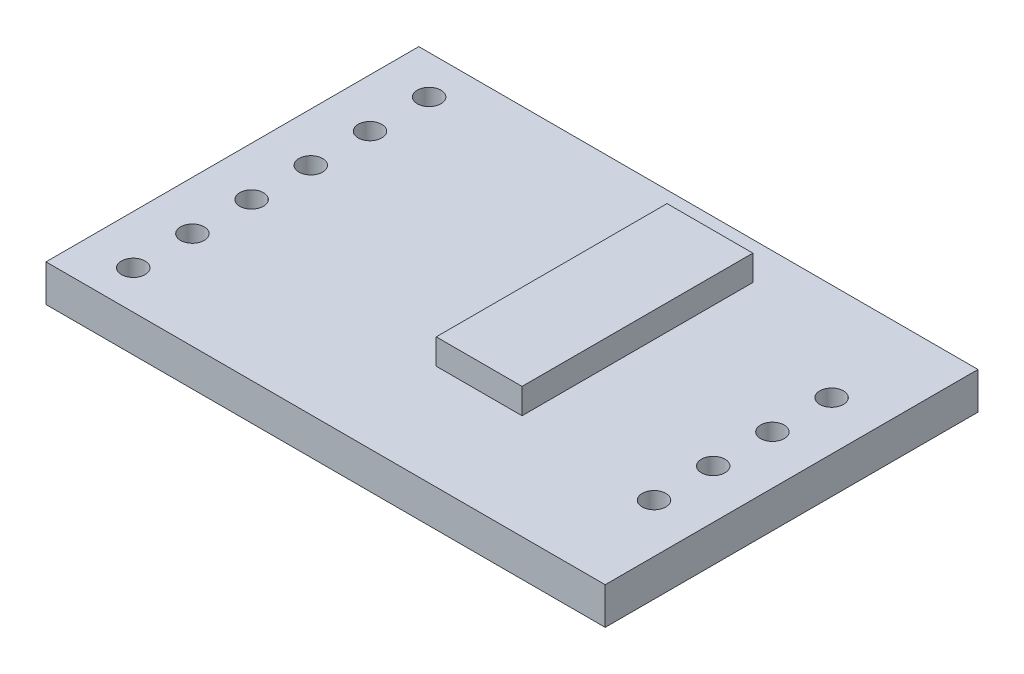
ISO-10303-21;
HEADER;
FILE_DESCRIPTION(('STEP AP214'),'2;1');
FILE_NAME('part.step','',(''),(''),'','','');
FILE_SCHEMA(('AUTOMOTIVE_DESIGN { 1 0 10303 214 1 1 1 1 }'));
ENDSEC;
DATA;
#1=APPLICATION_CONTEXT('core data for automotive mechanical design processes');
#2=APPLICATION_PROTOCOL_DEFINITION('international standard','automotive_design',2000,#1);
#3=PRODUCT_CONTEXT('',#1,'mechanical');
#4=PRODUCT('Part','Part','',(#3));
#5=PRODUCT_RELATED_PRODUCT_CATEGORY('part','',(#4));
#6=PRODUCT_DEFINITION_FORMATION('','',#4);
#7=PRODUCT_DEFINITION_CONTEXT('part definition',#1,'design');
#8=PRODUCT_DEFINITION('design','',#6,#7);
#9=PRODUCT_DEFINITION_SHAPE('','',#8);
#10=(LENGTH_UNIT() NAMED_UNIT(*) SI_UNIT(.MILLI.,.METRE.));
#11=(NAMED_UNIT(*) PLANE_ANGLE_UNIT() SI_UNIT($,.RADIAN.));
#12=(NAMED_UNIT(*) SI_UNIT($,.STERADIAN.) SOLID_ANGLE_UNIT());
#13=UNCERTAINTY_MEASURE_WITH_UNIT(LENGTH_MEASURE(1.E-05),#10,'distance_accuracy_value','');
#14=(GEOMETRIC_REPRESENTATION_CONTEXT(3) GLOBAL_UNCERTAINTY_ASSIGNED_CONTEXT((#13)) GLOBAL_UNIT_ASSIGNED_CONTEXT((#10,
#11,#12)) REPRESENTATION_CONTEXT('',''));
#15=CARTESIAN_POINT('',(0.,0.,0.));
#16=DIRECTION('',(0.,0.,1.));
#17=DIRECTION('',(1.,0.,0.));
#18=AXIS2_PLACEMENT_3D('',#15,#16,#17);
#19=CARTESIAN_POINT('',(3.93699999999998,2.6797,3.5062));
#20=DIRECTION('',(-1.,0.,0.));
#21=DIRECTION('',(0.,0.,1.));
#22=AXIS2_PLACEMENT_3D('',#19,#20,#21);
#23=PLANE('',#22);
#24=DIRECTION('',(0.,0.,-1.));
#25=VECTOR('',#24,1.);
#26=CARTESIAN_POINT('',(3.93699999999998,1.5875,3.5062));
#27=LINE('',#26,#25);
#28=CARTESIAN_POINT('',(3.93699999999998,1.5875,3.5062));
#29=VERTEX_POINT('',#28);
#30=CARTESIAN_POINT('',(3.93699999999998,1.5875,-6.3998));
#31=VERTEX_POINT('',#30);
#32=EDGE_CURVE('E107',#29,#31,#27,.T.);
#33=ORIENTED_EDGE('',*,*,#32,.T.);
#34=DIRECTION('',(0.,-1.,0.));
#35=VECTOR('',#34,1.);
#36=CARTESIAN_POINT('',(3.93699999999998,2.6797,-6.3998));
#37=LINE('',#36,#35);
#38=CARTESIAN_POINT('',(3.93699999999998,2.6797,-6.3998));
#39=VERTEX_POINT('',#38);
#40=EDGE_CURVE('E12',#39,#31,#37,.T.);
#41=ORIENTED_EDGE('',*,*,#40,.F.);
#42=DIRECTION('',(0.,0.,-1.));
#43=VECTOR('',#42,1.);
#44=CARTESIAN_POINT('',(3.93699999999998,2.6797,3.5062));
#45=LINE('',#44,#43);
#46=CARTESIAN_POINT('',(3.93699999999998,2.6797,3.5062));
#47=VERTEX_POINT('',#46);
#48=EDGE_CURVE('E95',#47,#39,#45,.T.);
#49=ORIENTED_EDGE('',*,*,#48,.F.);
#50=DIRECTION('',(0.,-1.,0.));
#51=VECTOR('',#50,1.);
#52=CARTESIAN_POINT('',(3.93699999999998,2.6797,3.5062));
#53=LINE('',#52,#51);
#54=EDGE_CURVE('E103',#47,#29,#53,.T.);
#55=ORIENTED_EDGE('',*,*,#54,.T.);
#56=EDGE_LOOP('',(#33,#41,#49,#55));
#57=FACE_BOUND('',#56,.T.);
#58=ADVANCED_FACE('F44',(#57),#23,.F.);
#59=CARTESIAN_POINT('',(0.25399999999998,2.6797,-6.3998));
#60=DIRECTION('',(0.,0.,1.));
#61=DIRECTION('',(1.,0.,0.));
#62=AXIS2_PLACEMENT_3D('',#59,#60,#61);
#63=PLANE('',#62);
#64=DIRECTION('',(-1.,0.,0.));
#65=VECTOR('',#64,1.);
#66=CARTESIAN_POINT('',(0.25399999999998,1.5875,-6.3998));
#67=LINE('',#66,#65);
#68=CARTESIAN_POINT('',(0.25399999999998,1.5875,-6.3998));
#69=VERTEX_POINT('',#68);
#70=EDGE_CURVE('E99',#31,#69,#67,.T.);
#71=ORIENTED_EDGE('',*,*,#70,.T.);
#72=DIRECTION('',(0.,-1.,0.));
#73=VECTOR('',#72,1.);
#74=CARTESIAN_POINT('',(0.25399999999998,2.6797,-6.3998));
#75=LINE('',#74,#73);
#76=CARTESIAN_POINT('',(0.25399999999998,2.6797,-6.3998));
#77=VERTEX_POINT('',#76);
#78=EDGE_CURVE('E52',#77,#69,#75,.T.);
#79=ORIENTED_EDGE('',*,*,#78,.F.);
#80=DIRECTION('',(-1.,0.,0.));
#81=VECTOR('',#80,1.);
#82=CARTESIAN_POINT('',(0.25399999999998,2.6797,-6.3998));
#83=LINE('',#82,#81);
#84=EDGE_CURVE('E90',#39,#77,#83,.T.);
#85=ORIENTED_EDGE('',*,*,#84,.F.);
#86=ORIENTED_EDGE('',*,*,#40,.T.);
#87=EDGE_LOOP('',(#71,#79,#85,#86));
#88=FACE_BOUND('',#87,.T.);
#89=ADVANCED_FACE('F98',(#88),#63,.F.);
#90=CARTESIAN_POINT('',(0.25399999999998,2.6797,3.5062));
#91=DIRECTION('',(1.,0.,0.));
#92=DIRECTION('',(0.,0.,-1.));
#93=AXIS2_PLACEMENT_3D('',#90,#91,#92);
#94=PLANE('',#93);
#95=DIRECTION('',(0.,0.,1.));
#96=VECTOR('',#95,1.);
#97=CARTESIAN_POINT('',(0.25399999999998,1.5875,3.5062));
#98=LINE('',#97,#96);
#99=CARTESIAN_POINT('',(0.25399999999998,1.5875,3.5062));
#100=VERTEX_POINT('',#99);
#101=EDGE_CURVE('E77',#69,#100,#98,.T.);
#102=ORIENTED_EDGE('',*,*,#101,.T.);
#103=DIRECTION('',(0.,-1.,0.));
#104=VECTOR('',#103,1.);
#105=CARTESIAN_POINT('',(0.25399999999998,2.6797,3.5062));
#106=LINE('',#105,#104);
#107=CARTESIAN_POINT('',(0.25399999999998,2.6797,3.5062));
#108=VERTEX_POINT('',#107);
#109=EDGE_CURVE('E100',#108,#100,#106,.T.);
#110=ORIENTED_EDGE('',*,*,#109,.F.);
#111=DIRECTION('',(0.,0.,1.));
#112=VECTOR('',#111,1.);
#113=CARTESIAN_POINT('',(0.25399999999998,2.6797,3.5062));
#114=LINE('',#113,#112);
#115=EDGE_CURVE('E93',#77,#108,#114,.T.);
#116=ORIENTED_EDGE('',*,*,#115,.F.);
#117=ORIENTED_EDGE('',*,*,#78,.T.);
#118=EDGE_LOOP('',(#102,#110,#116,#117));
#119=FACE_BOUND('',#118,.T.);
#120=ADVANCED_FACE('F101',(#119),#94,.F.);
#121=CARTESIAN_POINT('',(0.25399999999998,2.6797,3.5062));
#122=DIRECTION('',(0.,0.,-1.));
#123=DIRECTION('',(-1.,0.,0.));
#124=AXIS2_PLACEMENT_3D('',#121,#122,#123);
#125=PLANE('',#124);
#126=DIRECTION('',(1.,0.,0.));
#127=VECTOR('',#126,1.);
#128=CARTESIAN_POINT('',(0.25399999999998,1.5875,3.5062));
#129=LINE('',#128,#127);
#130=EDGE_CURVE('E83',#100,#29,#129,.T.);
#131=ORIENTED_EDGE('',*,*,#130,.T.);
#132=ORIENTED_EDGE('',*,*,#54,.F.);
#133=DIRECTION('',(1.,0.,0.));
#134=VECTOR('',#133,1.);
#135=CARTESIAN_POINT('',(0.25399999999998,2.6797,3.5062));
#136=LINE('',#135,#134);
#137=EDGE_CURVE('E60',#108,#47,#136,.T.);
#138=ORIENTED_EDGE('',*,*,#137,.F.);
#139=ORIENTED_EDGE('',*,*,#109,.T.);
#140=EDGE_LOOP('',(#131,#132,#138,#139));
#141=FACE_BOUND('',#140,.T.);
#142=ADVANCED_FACE('F114',(#141),#125,.F.);
#143=CARTESIAN_POINT('',(0.,2.6797,0.));
#144=DIRECTION('',(0.,-1.,0.));
#145=DIRECTION('',(0.,0.,-1.));
#146=AXIS2_PLACEMENT_3D('',#143,#144,#145);
#147=PLANE('',#146);
#148=ORIENTED_EDGE('',*,*,#48,.T.);
#149=ORIENTED_EDGE('',*,*,#84,.T.);
#150=ORIENTED_EDGE('',*,*,#115,.T.);
#151=ORIENTED_EDGE('',*,*,#137,.T.);
#152=EDGE_LOOP('',(#148,#149,#150,#151));
#153=FACE_BOUND('',#152,.T.);
#154=ADVANCED_FACE('F91',(#153),#147,.F.);
#155=CARTESIAN_POINT('',(0.,1.5875,0.));
#156=DIRECTION('',(0.,-1.,0.));
#157=DIRECTION('',(0.,0.,-1.));
#158=AXIS2_PLACEMENT_3D('',#155,#156,#157);
#159=PLANE('',#158);
#160=ORIENTED_EDGE('',*,*,#32,.F.);
#161=ORIENTED_EDGE('',*,*,#130,.F.);
#162=ORIENTED_EDGE('',*,*,#101,.F.);
#163=ORIENTED_EDGE('',*,*,#70,.F.);
#164=EDGE_LOOP('',(#160,#161,#162,#163));
#165=FACE_BOUND('',#164,.T.);
#166=ADVANCED_FACE('F117',(#165),#159,.T.);
#167=CLOSED_SHELL('',(#58,#89,#120,#142,#154,#166));
#168=MANIFOLD_SOLID_BREP('B2',#167);
#169=CARTESIAN_POINT('',(0.,1.5875,0.));
#170=DIRECTION('',(0.,-1.,0.));
#171=DIRECTION('',(0.,0.,-1.));
#172=AXIS2_PLACEMENT_3D('',#169,#170,#171);
#173=PLANE('',#172);
#174=CARTESIAN_POINT('',(-9.90600000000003,1.5875,-3.81));
#175=DIRECTION('',(0.,1.,0.));
#176=DIRECTION('',(0.,0.,1.));
#177=AXIS2_PLACEMENT_3D('',#174,#175,#176);
#178=CIRCLE('',#177,0.508);
#179=CARTESIAN_POINT('',(-9.90600000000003,1.5875,-3.302));
#180=VERTEX_POINT('',#179);
#181=EDGE_CURVE('E291',#180,#180,#178,.T.);
#182=ORIENTED_EDGE('',*,*,#181,.F.);
#183=EDGE_LOOP('',(#182));
#184=FACE_BOUND('',#183,.T.);
#185=CARTESIAN_POINT('',(-9.90600000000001,1.5875,1.27));
#186=DIRECTION('',(0.,1.,0.));
#187=DIRECTION('',(0.,0.,1.));
#188=AXIS2_PLACEMENT_3D('',#185,#186,#187);
#189=CIRCLE('',#188,0.508);
#190=CARTESIAN_POINT('',(-9.90600000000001,1.5875,1.778));
#191=VERTEX_POINT('',#190);
#192=EDGE_CURVE('E279',#191,#191,#189,.T.);
#193=ORIENTED_EDGE('',*,*,#192,.F.);
#194=EDGE_LOOP('',(#193));
#195=FACE_BOUND('',#194,.T.);
#196=CARTESIAN_POINT('',(9.90599999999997,1.5875,-3.81));
#197=DIRECTION('',(0.,1.,0.));
#198=DIRECTION('',(0.,0.,1.));
#199=AXIS2_PLACEMENT_3D('',#196,#197,#198);
#200=CIRCLE('',#199,0.508);
#201=CARTESIAN_POINT('',(9.90599999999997,1.5875,-3.302));
#202=VERTEX_POINT('',#201);
#203=EDGE_CURVE('E267',#202,#202,#200,.T.);
#204=ORIENTED_EDGE('',*,*,#203,.F.);
#205=EDGE_LOOP('',(#204));
#206=FACE_BOUND('',#205,.T.);
#207=CARTESIAN_POINT('',(9.90599999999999,1.5875,1.27));
#208=DIRECTION('',(0.,1.,0.));
#209=DIRECTION('',(0.,0.,1.));
#210=AXIS2_PLACEMENT_3D('',#207,#208,#209);
#211=CIRCLE('',#210,0.508);
#212=CARTESIAN_POINT('',(9.90599999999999,1.5875,1.778));
#213=VERTEX_POINT('',#212);
#214=EDGE_CURVE('E255',#213,#213,#211,.T.);
#215=ORIENTED_EDGE('',*,*,#214,.F.);
#216=EDGE_LOOP('',(#215));
#217=FACE_BOUND('',#216,.T.);
#218=CARTESIAN_POINT('',(-9.906,1.5875,6.35));
#219=DIRECTION('',(0.,1.,0.));
#220=DIRECTION('',(0.,0.,1.));
#221=AXIS2_PLACEMENT_3D('',#218,#219,#220);
#222=CIRCLE('',#221,0.508);
#223=CARTESIAN_POINT('',(-9.906,1.5875,6.858));
#224=VERTEX_POINT('',#223);
#225=EDGE_CURVE('E234',#224,#224,#222,.T.);
#226=ORIENTED_EDGE('',*,*,#225,.F.);
#227=EDGE_LOOP('',(#226));
#228=FACE_BOUND('',#227,.T.);
#229=DIRECTION('',(0.,0.,-1.));
#230=VECTOR('',#229,1.);
#231=CARTESIAN_POINT('',(12.,1.5875,8.));
#232=LINE('',#231,#230);
#233=CARTESIAN_POINT('',(12.,1.5875,8.));
#234=VERTEX_POINT('',#233);
#235=CARTESIAN_POINT('',(12.,1.5875,-8.));
#236=VERTEX_POINT('',#235);
#237=EDGE_CURVE('E219',#234,#236,#232,.T.);
#238=ORIENTED_EDGE('',*,*,#237,.T.);
#239=DIRECTION('',(-1.,0.,0.));
#240=VECTOR('',#239,1.);
#241=CARTESIAN_POINT('',(-12.,1.5875,-8.));
#242=LINE('',#241,#240);
#243=CARTESIAN_POINT('',(-12.,1.5875,-8.));
#244=VERTEX_POINT('',#243);
#245=EDGE_CURVE('E214',#236,#244,#242,.T.);
#246=ORIENTED_EDGE('',*,*,#245,.T.);
#247=DIRECTION('',(0.,0.,1.));
#248=VECTOR('',#247,1.);
#249=CARTESIAN_POINT('',(-12.,1.5875,8.));
#250=LINE('',#249,#248);
#251=CARTESIAN_POINT('',(-12.,1.5875,8.));
#252=VERTEX_POINT('',#251);
#253=EDGE_CURVE('E217',#244,#252,#250,.T.);
#254=ORIENTED_EDGE('',*,*,#253,.T.);
#255=DIRECTION('',(1.,0.,0.));
#256=VECTOR('',#255,1.);
#257=CARTESIAN_POINT('',(-12.,1.5875,8.));
#258=LINE('',#257,#256);
#259=EDGE_CURVE('E184',#252,#234,#258,.T.);
#260=ORIENTED_EDGE('',*,*,#259,.T.);
#261=EDGE_LOOP('',(#238,#246,#254,#260));
#262=FACE_BOUND('',#261,.T.);
#263=CARTESIAN_POINT('',(9.906,1.5875,3.81));
#264=DIRECTION('',(0.,1.,0.));
#265=DIRECTION('',(0.,0.,1.));
#266=AXIS2_PLACEMENT_3D('',#263,#264,#265);
#267=CIRCLE('',#266,0.508);
#268=CARTESIAN_POINT('',(9.906,1.5875,4.318));
#269=VERTEX_POINT('',#268);
#270=EDGE_CURVE('E249',#269,#269,#267,.T.);
#271=ORIENTED_EDGE('',*,*,#270,.F.);
#272=EDGE_LOOP('',(#271));
#273=FACE_BOUND('',#272,.T.);
#274=CARTESIAN_POINT('',(9.90599999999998,1.5875,-1.27));
#275=DIRECTION('',(0.,1.,0.));
#276=DIRECTION('',(0.,0.,1.));
#277=AXIS2_PLACEMENT_3D('',#274,#275,#276);
#278=CIRCLE('',#277,0.508);
#279=CARTESIAN_POINT('',(9.90599999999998,1.5875,-0.762));
#280=VERTEX_POINT('',#279);
#281=EDGE_CURVE('E261',#280,#280,#278,.T.);
#282=ORIENTED_EDGE('',*,*,#281,.F.);
#283=EDGE_LOOP('',(#282));
#284=FACE_BOUND('',#283,.T.);
#285=CARTESIAN_POINT('',(-9.906,1.5875,3.81));
#286=DIRECTION('',(0.,1.,0.));
#287=DIRECTION('',(0.,0.,1.));
#288=AXIS2_PLACEMENT_3D('',#285,#286,#287);
#289=CIRCLE('',#288,0.508);
#290=CARTESIAN_POINT('',(-9.906,1.5875,4.318));
#291=VERTEX_POINT('',#290);
#292=EDGE_CURVE('E273',#291,#291,#289,.T.);
#293=ORIENTED_EDGE('',*,*,#292,.F.);
#294=EDGE_LOOP('',(#293));
#295=FACE_BOUND('',#294,.T.);
#296=CARTESIAN_POINT('',(-9.90600000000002,1.5875,-1.27));
#297=DIRECTION('',(0.,1.,0.));
#298=DIRECTION('',(0.,0.,1.));
#299=AXIS2_PLACEMENT_3D('',#296,#297,#298);
#300=CIRCLE('',#299,0.508);
#301=CARTESIAN_POINT('',(-9.90600000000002,1.5875,-0.762));
#302=VERTEX_POINT('',#301);
#303=EDGE_CURVE('E285',#302,#302,#300,.T.);
#304=ORIENTED_EDGE('',*,*,#303,.F.);
#305=EDGE_LOOP('',(#304));
#306=FACE_BOUND('',#305,.T.);
#307=CARTESIAN_POINT('',(-9.90600000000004,1.5875,-6.35));
#308=DIRECTION('',(0.,1.,0.));
#309=DIRECTION('',(0.,0.,1.));
#310=AXIS2_PLACEMENT_3D('',#307,#308,#309);
#311=CIRCLE('',#310,0.508);
#312=CARTESIAN_POINT('',(-9.90600000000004,1.5875,-5.842));
#313=VERTEX_POINT('',#312);
#314=EDGE_CURVE('E297',#313,#313,#311,.T.);
#315=ORIENTED_EDGE('',*,*,#314,.F.);
#316=EDGE_LOOP('',(#315));
#317=FACE_BOUND('',#316,.T.);
#318=ADVANCED_FACE('F167',(#184,#195,#206,#217,#228,#262,#273,#284,#295,#306,#317),#173,.F.);
#319=CARTESIAN_POINT('',(0.,0.,0.));
#320=DIRECTION('',(0.,-1.,0.));
#321=DIRECTION('',(0.,0.,-1.));
#322=AXIS2_PLACEMENT_3D('',#319,#320,#321);
#323=PLANE('',#322);
#324=CARTESIAN_POINT('',(-9.90600000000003,0.,-3.81));
#325=DIRECTION('',(0.,1.,0.));
#326=DIRECTION('',(0.,0.,1.));
#327=AXIS2_PLACEMENT_3D('',#324,#325,#326);
#328=CIRCLE('',#327,0.508);
#329=CARTESIAN_POINT('',(-9.90600000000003,0.,-3.302));
#330=VERTEX_POINT('',#329);
#331=EDGE_CURVE('E294',#330,#330,#328,.T.);
#332=ORIENTED_EDGE('',*,*,#331,.T.);
#333=EDGE_LOOP('',(#332));
#334=FACE_BOUND('',#333,.T.);
#335=CARTESIAN_POINT('',(-9.90600000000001,0.,1.27));
#336=DIRECTION('',(0.,1.,0.));
#337=DIRECTION('',(0.,0.,1.));
#338=AXIS2_PLACEMENT_3D('',#335,#336,#337);
#339=CIRCLE('',#338,0.508);
#340=CARTESIAN_POINT('',(-9.90600000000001,0.,1.778));
#341=VERTEX_POINT('',#340);
#342=EDGE_CURVE('E282',#341,#341,#339,.T.);
#343=ORIENTED_EDGE('',*,*,#342,.T.);
#344=EDGE_LOOP('',(#343));
#345=FACE_BOUND('',#344,.T.);
#346=CARTESIAN_POINT('',(9.90599999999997,0.,-3.81));
#347=DIRECTION('',(0.,1.,0.));
#348=DIRECTION('',(0.,0.,1.));
#349=AXIS2_PLACEMENT_3D('',#346,#347,#348);
#350=CIRCLE('',#349,0.508);
#351=CARTESIAN_POINT('',(9.90599999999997,0.,-3.302));
#352=VERTEX_POINT('',#351);
#353=EDGE_CURVE('E270',#352,#352,#350,.T.);
#354=ORIENTED_EDGE('',*,*,#353,.T.);
#355=EDGE_LOOP('',(#354));
#356=FACE_BOUND('',#355,.T.);
#357=CARTESIAN_POINT('',(9.90599999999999,0.,1.27));
#358=DIRECTION('',(0.,1.,0.));
#359=DIRECTION('',(0.,0.,1.));
#360=AXIS2_PLACEMENT_3D('',#357,#358,#359);
#361=CIRCLE('',#360,0.508);
#362=CARTESIAN_POINT('',(9.90599999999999,0.,1.778));
#363=VERTEX_POINT('',#362);
#364=EDGE_CURVE('E258',#363,#363,#361,.T.);
#365=ORIENTED_EDGE('',*,*,#364,.T.);
#366=EDGE_LOOP('',(#365));
#367=FACE_BOUND('',#366,.T.);
#368=CARTESIAN_POINT('',(-9.906,0.,6.35));
#369=DIRECTION('',(0.,1.,0.));
#370=DIRECTION('',(0.,0.,1.));
#371=AXIS2_PLACEMENT_3D('',#368,#369,#370);
#372=CIRCLE('',#371,0.508);
#373=CARTESIAN_POINT('',(-9.906,0.,6.858));
#374=VERTEX_POINT('',#373);
#375=EDGE_CURVE('E246',#374,#374,#372,.T.);
#376=ORIENTED_EDGE('',*,*,#375,.T.);
#377=EDGE_LOOP('',(#376));
#378=FACE_BOUND('',#377,.T.);
#379=DIRECTION('',(0.,0.,-1.));
#380=VECTOR('',#379,1.);
#381=CARTESIAN_POINT('',(12.,0.,8.));
#382=LINE('',#381,#380);
#383=CARTESIAN_POINT('',(12.,0.,8.));
#384=VERTEX_POINT('',#383);
#385=CARTESIAN_POINT('',(12.,0.,-8.));
#386=VERTEX_POINT('',#385);
#387=EDGE_CURVE('E231',#384,#386,#382,.T.);
#388=ORIENTED_EDGE('',*,*,#387,.F.);
#389=DIRECTION('',(1.,0.,0.));
#390=VECTOR('',#389,1.);
#391=CARTESIAN_POINT('',(-12.,0.,8.));
#392=LINE('',#391,#390);
#393=CARTESIAN_POINT('',(-12.,0.,8.));
#394=VERTEX_POINT('',#393);
#395=EDGE_CURVE('E207',#394,#384,#392,.T.);
#396=ORIENTED_EDGE('',*,*,#395,.F.);
#397=DIRECTION('',(0.,0.,1.));
#398=VECTOR('',#397,1.);
#399=CARTESIAN_POINT('',(-12.,0.,8.));
#400=LINE('',#399,#398);
#401=CARTESIAN_POINT('',(-12.,0.,-8.));
#402=VERTEX_POINT('',#401);
#403=EDGE_CURVE('E201',#402,#394,#400,.T.);
#404=ORIENTED_EDGE('',*,*,#403,.F.);
#405=DIRECTION('',(-1.,0.,0.));
#406=VECTOR('',#405,1.);
#407=CARTESIAN_POINT('',(-12.,0.,-8.));
#408=LINE('',#407,#406);
#409=EDGE_CURVE('E223',#386,#402,#408,.T.);
#410=ORIENTED_EDGE('',*,*,#409,.F.);
#411=EDGE_LOOP('',(#388,#396,#404,#410));
#412=FACE_BOUND('',#411,.T.);
#413=CARTESIAN_POINT('',(9.906,0.,3.81));
#414=DIRECTION('',(0.,1.,0.));
#415=DIRECTION('',(0.,0.,1.));
#416=AXIS2_PLACEMENT_3D('',#413,#414,#415);
#417=CIRCLE('',#416,0.508);
#418=CARTESIAN_POINT('',(9.906,0.,4.318));
#419=VERTEX_POINT('',#418);
#420=EDGE_CURVE('E252',#419,#419,#417,.T.);
#421=ORIENTED_EDGE('',*,*,#420,.T.);
#422=EDGE_LOOP('',(#421));
#423=FACE_BOUND('',#422,.T.);
#424=CARTESIAN_POINT('',(9.90599999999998,0.,-1.27));
#425=DIRECTION('',(0.,1.,0.));
#426=DIRECTION('',(0.,0.,1.));
#427=AXIS2_PLACEMENT_3D('',#424,#425,#426);
#428=CIRCLE('',#427,0.508);
#429=CARTESIAN_POINT('',(9.90599999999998,0.,-0.762));
#430=VERTEX_POINT('',#429);
#431=EDGE_CURVE('E264',#430,#430,#428,.T.);
#432=ORIENTED_EDGE('',*,*,#431,.T.);
#433=EDGE_LOOP('',(#432));
#434=FACE_BOUND('',#433,.T.);
#435=CARTESIAN_POINT('',(-9.906,0.,3.81));
#436=DIRECTION('',(0.,1.,0.));
#437=DIRECTION('',(0.,0.,1.));
#438=AXIS2_PLACEMENT_3D('',#435,#436,#437);
#439=CIRCLE('',#438,0.508);
#440=CARTESIAN_POINT('',(-9.906,0.,4.318));
#441=VERTEX_POINT('',#440);
#442=EDGE_CURVE('E276',#441,#441,#439,.T.);
#443=ORIENTED_EDGE('',*,*,#442,.T.);
#444=EDGE_LOOP('',(#443));
#445=FACE_BOUND('',#444,.T.);
#446=CARTESIAN_POINT('',(-9.90600000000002,0.,-1.27));
#447=DIRECTION('',(0.,1.,0.));
#448=DIRECTION('',(0.,0.,1.));
#449=AXIS2_PLACEMENT_3D('',#446,#447,#448);
#450=CIRCLE('',#449,0.508);
#451=CARTESIAN_POINT('',(-9.90600000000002,0.,-0.762));
#452=VERTEX_POINT('',#451);
#453=EDGE_CURVE('E288',#452,#452,#450,.T.);
#454=ORIENTED_EDGE('',*,*,#453,.T.);
#455=EDGE_LOOP('',(#454));
#456=FACE_BOUND('',#455,.T.);
#457=CARTESIAN_POINT('',(-9.90600000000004,0.,-6.35));
#458=DIRECTION('',(0.,1.,0.));
#459=DIRECTION('',(0.,0.,1.));
#460=AXIS2_PLACEMENT_3D('',#457,#458,#459);
#461=CIRCLE('',#460,0.508);
#462=CARTESIAN_POINT('',(-9.90600000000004,0.,-5.842));
#463=VERTEX_POINT('',#462);
#464=EDGE_CURVE('E300',#463,#463,#461,.T.);
#465=ORIENTED_EDGE('',*,*,#464,.T.);
#466=EDGE_LOOP('',(#465));
#467=FACE_BOUND('',#466,.T.);
#468=ADVANCED_FACE('F242',(#334,#345,#356,#367,#378,#412,#423,#434,#445,#456,#467),#323,.T.);
#469=CARTESIAN_POINT('',(12.,1.5875,8.));
#470=DIRECTION('',(-1.,0.,0.));
#471=DIRECTION('',(0.,0.,1.));
#472=AXIS2_PLACEMENT_3D('',#469,#470,#471);
#473=PLANE('',#472);
#474=ORIENTED_EDGE('',*,*,#387,.T.);
#475=DIRECTION('',(0.,-1.,0.));
#476=VECTOR('',#475,1.);
#477=CARTESIAN_POINT('',(12.,1.5875,-8.));
#478=LINE('',#477,#476);
#479=EDGE_CURVE('E42',#236,#386,#478,.T.);
#480=ORIENTED_EDGE('',*,*,#479,.F.);
#481=ORIENTED_EDGE('',*,*,#237,.F.);
#482=DIRECTION('',(0.,-1.,0.));
#483=VECTOR('',#482,1.);
#484=CARTESIAN_POINT('',(12.,1.5875,8.));
#485=LINE('',#484,#483);
#486=EDGE_CURVE('E227',#234,#384,#485,.T.);
#487=ORIENTED_EDGE('',*,*,#486,.T.);
#488=EDGE_LOOP('',(#474,#480,#481,#487));
#489=FACE_BOUND('',#488,.T.);
#490=ADVANCED_FACE('F169',(#489),#473,.F.);
#491=CARTESIAN_POINT('',(-12.,1.5875,-8.));
#492=DIRECTION('',(0.,0.,1.));
#493=DIRECTION('',(1.,0.,0.));
#494=AXIS2_PLACEMENT_3D('',#491,#492,#493);
#495=PLANE('',#494);
#496=ORIENTED_EDGE('',*,*,#409,.T.);
#497=DIRECTION('',(0.,-1.,0.));
#498=VECTOR('',#497,1.);
#499=CARTESIAN_POINT('',(-12.,1.5875,-8.));
#500=LINE('',#499,#498);
#501=EDGE_CURVE('E176',#244,#402,#500,.T.);
#502=ORIENTED_EDGE('',*,*,#501,.F.);
#503=ORIENTED_EDGE('',*,*,#245,.F.);
#504=ORIENTED_EDGE('',*,*,#479,.T.);
#505=EDGE_LOOP('',(#496,#502,#503,#504));
#506=FACE_BOUND('',#505,.T.);
#507=ADVANCED_FACE('F222',(#506),#495,.F.);
#508=CARTESIAN_POINT('',(-12.,1.5875,8.));
#509=DIRECTION('',(1.,0.,0.));
#510=DIRECTION('',(0.,0.,-1.));
#511=AXIS2_PLACEMENT_3D('',#508,#509,#510);
#512=PLANE('',#511);
#513=ORIENTED_EDGE('',*,*,#403,.T.);
#514=DIRECTION('',(0.,-1.,0.));
#515=VECTOR('',#514,1.);
#516=CARTESIAN_POINT('',(-12.,1.5875,8.));
#517=LINE('',#516,#515);
#518=EDGE_CURVE('E224',#252,#394,#517,.T.);
#519=ORIENTED_EDGE('',*,*,#518,.F.);
#520=ORIENTED_EDGE('',*,*,#253,.F.);
#521=ORIENTED_EDGE('',*,*,#501,.T.);
#522=EDGE_LOOP('',(#513,#519,#520,#521));
#523=FACE_BOUND('',#522,.T.);
#524=ADVANCED_FACE('F225',(#523),#512,.F.);
#525=CARTESIAN_POINT('',(-12.,1.5875,8.));
#526=DIRECTION('',(0.,0.,-1.));
#527=DIRECTION('',(-1.,0.,0.));
#528=AXIS2_PLACEMENT_3D('',#525,#526,#527);
#529=PLANE('',#528);
#530=ORIENTED_EDGE('',*,*,#395,.T.);
#531=ORIENTED_EDGE('',*,*,#486,.F.);
#532=ORIENTED_EDGE('',*,*,#259,.F.);
#533=ORIENTED_EDGE('',*,*,#518,.T.);
#534=EDGE_LOOP('',(#530,#531,#532,#533));
#535=FACE_BOUND('',#534,.T.);
#536=ADVANCED_FACE('F239',(#535),#529,.F.);
#537=CARTESIAN_POINT('',(-9.906,1.5875,6.35));
#538=DIRECTION('',(0.,-1.,0.));
#539=DIRECTION('',(0.,0.,-1.));
#540=AXIS2_PLACEMENT_3D('',#537,#538,#539);
#541=CYLINDRICAL_SURFACE('',#540,0.508);
#542=ORIENTED_EDGE('',*,*,#225,.T.);
#543=EDGE_LOOP('',(#542));
#544=FACE_BOUND('',#543,.T.);
#545=ORIENTED_EDGE('',*,*,#375,.F.);
#546=EDGE_LOOP('',(#545));
#547=FACE_BOUND('',#546,.T.);
#548=ADVANCED_FACE('F320',(#544,#547),#541,.F.);
#549=CARTESIAN_POINT('',(9.906,1.5875,3.81));
#550=DIRECTION('',(0.,-1.,0.));
#551=DIRECTION('',(0.,0.,-1.));
#552=AXIS2_PLACEMENT_3D('',#549,#550,#551);
#553=CYLINDRICAL_SURFACE('',#552,0.508);
#554=ORIENTED_EDGE('',*,*,#270,.T.);
#555=EDGE_LOOP('',(#554));
#556=FACE_BOUND('',#555,.T.);
#557=ORIENTED_EDGE('',*,*,#420,.F.);
#558=EDGE_LOOP('',(#557));
#559=FACE_BOUND('',#558,.T.);
#560=ADVANCED_FACE('F368',(#556,#559),#553,.F.);
#561=CARTESIAN_POINT('',(9.90599999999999,1.5875,1.27));
#562=DIRECTION('',(0.,-1.,0.));
#563=DIRECTION('',(0.,0.,-1.));
#564=AXIS2_PLACEMENT_3D('',#561,#562,#563);
#565=CYLINDRICAL_SURFACE('',#564,0.508);
#566=ORIENTED_EDGE('',*,*,#214,.T.);
#567=EDGE_LOOP('',(#566));
#568=FACE_BOUND('',#567,.T.);
#569=ORIENTED_EDGE('',*,*,#364,.F.);
#570=EDGE_LOOP('',(#569));
#571=FACE_BOUND('',#570,.T.);
#572=ADVANCED_FACE('F376',(#568,#571),#565,.F.);
#573=CARTESIAN_POINT('',(9.90599999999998,1.5875,-1.27));
#574=DIRECTION('',(0.,-1.,0.));
#575=DIRECTION('',(0.,0.,-1.));
#576=AXIS2_PLACEMENT_3D('',#573,#574,#575);
#577=CYLINDRICAL_SURFACE('',#576,0.508);
#578=ORIENTED_EDGE('',*,*,#281,.T.);
#579=EDGE_LOOP('',(#578));
#580=FACE_BOUND('',#579,.T.);
#581=ORIENTED_EDGE('',*,*,#431,.F.);
#582=EDGE_LOOP('',(#581));
#583=FACE_BOUND('',#582,.T.);
#584=ADVANCED_FACE('F384',(#580,#583),#577,.F.);
#585=CARTESIAN_POINT('',(9.90599999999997,1.5875,-3.81));
#586=DIRECTION('',(0.,-1.,0.));
#587=DIRECTION('',(0.,0.,-1.));
#588=AXIS2_PLACEMENT_3D('',#585,#586,#587);
#589=CYLINDRICAL_SURFACE('',#588,0.508);
#590=ORIENTED_EDGE('',*,*,#203,.T.);
#591=EDGE_LOOP('',(#590));
#592=FACE_BOUND('',#591,.T.);
#593=ORIENTED_EDGE('',*,*,#353,.F.);
#594=EDGE_LOOP('',(#593));
#595=FACE_BOUND('',#594,.T.);
#596=ADVANCED_FACE('F393',(#592,#595),#589,.F.);
#597=CARTESIAN_POINT('',(-9.906,1.5875,3.81));
#598=DIRECTION('',(0.,-1.,0.));
#599=DIRECTION('',(0.,0.,-1.));
#600=AXIS2_PLACEMENT_3D('',#597,#598,#599);
#601=CYLINDRICAL_SURFACE('',#600,0.508);
#602=ORIENTED_EDGE('',*,*,#292,.T.);
#603=EDGE_LOOP('',(#602));
#604=FACE_BOUND('',#603,.T.);
#605=ORIENTED_EDGE('',*,*,#442,.F.);
#606=EDGE_LOOP('',(#605));
#607=FACE_BOUND('',#606,.T.);
#608=ADVANCED_FACE('F402',(#604,#607),#601,.F.);
#609=CARTESIAN_POINT('',(-9.90600000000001,1.5875,1.27));
#610=DIRECTION('',(0.,-1.,0.));
#611=DIRECTION('',(0.,0.,-1.));
#612=AXIS2_PLACEMENT_3D('',#609,#610,#611);
#613=CYLINDRICAL_SURFACE('',#612,0.508);
#614=ORIENTED_EDGE('',*,*,#192,.T.);
#615=EDGE_LOOP('',(#614));
#616=FACE_BOUND('',#615,.T.);
#617=ORIENTED_EDGE('',*,*,#342,.F.);
#618=EDGE_LOOP('',(#617));
#619=FACE_BOUND('',#618,.T.);
#620=ADVANCED_FACE('F411',(#616,#619),#613,.F.);
#621=CARTESIAN_POINT('',(-9.90600000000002,1.5875,-1.27));
#622=DIRECTION('',(0.,-1.,0.));
#623=DIRECTION('',(0.,0.,-1.));
#624=AXIS2_PLACEMENT_3D('',#621,#622,#623);
#625=CYLINDRICAL_SURFACE('',#624,0.508);
#626=ORIENTED_EDGE('',*,*,#303,.T.);
#627=EDGE_LOOP('',(#626));
#628=FACE_BOUND('',#627,.T.);
#629=ORIENTED_EDGE('',*,*,#453,.F.);
#630=EDGE_LOOP('',(#629));
#631=FACE_BOUND('',#630,.T.);
#632=ADVANCED_FACE('F420',(#628,#631),#625,.F.);
#633=CARTESIAN_POINT('',(-9.90600000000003,1.5875,-3.81));
#634=DIRECTION('',(0.,-1.,0.));
#635=DIRECTION('',(0.,0.,-1.));
#636=AXIS2_PLACEMENT_3D('',#633,#634,#635);
#637=CYLINDRICAL_SURFACE('',#636,0.508);
#638=ORIENTED_EDGE('',*,*,#181,.T.);
#639=EDGE_LOOP('',(#638));
#640=FACE_BOUND('',#639,.T.);
#641=ORIENTED_EDGE('',*,*,#331,.F.);
#642=EDGE_LOOP('',(#641));
#643=FACE_BOUND('',#642,.T.);
#644=ADVANCED_FACE('F429',(#640,#643),#637,.F.);
#645=CARTESIAN_POINT('',(-9.90600000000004,1.5875,-6.35));
#646=DIRECTION('',(0.,-1.,0.));
#647=DIRECTION('',(0.,0.,-1.));
#648=AXIS2_PLACEMENT_3D('',#645,#646,#647);
#649=CYLINDRICAL_SURFACE('',#648,0.508);
#650=ORIENTED_EDGE('',*,*,#314,.T.);
#651=EDGE_LOOP('',(#650));
#652=FACE_BOUND('',#651,.T.);
#653=ORIENTED_EDGE('',*,*,#464,.F.);
#654=EDGE_LOOP('',(#653));
#655=FACE_BOUND('',#654,.T.);
#656=ADVANCED_FACE('F306',(#652,#655),#649,.F.);
#657=CLOSED_SHELL('',(#318,#468,#490,#507,#524,#536,#548,#560,#572,#584,#596,#608,#620,#632,
#644,#656));
#658=MANIFOLD_SOLID_BREP('B6',#657);
#659=ADVANCED_BREP_SHAPE_REPRESENTATION('',(#18,#168,#658),#14);
#660=SHAPE_DEFINITION_REPRESENTATION(#9,#659);
ENDSEC;
END-ISO-10303-21;
